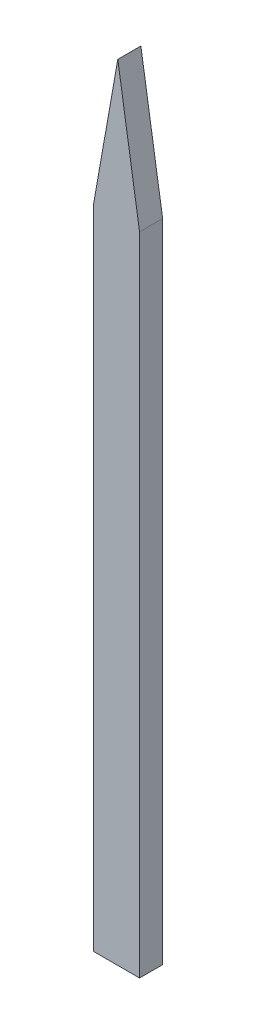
ISO-10303-21;
HEADER;
FILE_DESCRIPTION(('STEP AP214'),'2;1');
FILE_NAME('part.step','',(''),(''),'','','');
FILE_SCHEMA(('AUTOMOTIVE_DESIGN { 1 0 10303 214 1 1 1 1 }'));
ENDSEC;
DATA;
#1=APPLICATION_CONTEXT('core data for automotive mechanical design processes');
#2=APPLICATION_PROTOCOL_DEFINITION('international standard','automotive_design',2000,#1);
#3=PRODUCT_CONTEXT('',#1,'mechanical');
#4=PRODUCT('Part','Part','',(#3));
#5=PRODUCT_RELATED_PRODUCT_CATEGORY('part','',(#4));
#6=PRODUCT_DEFINITION_FORMATION('','',#4);
#7=PRODUCT_DEFINITION_CONTEXT('part definition',#1,'design');
#8=PRODUCT_DEFINITION('design','',#6,#7);
#9=PRODUCT_DEFINITION_SHAPE('','',#8);
#10=(LENGTH_UNIT() NAMED_UNIT(*) SI_UNIT(.MILLI.,.METRE.));
#11=(NAMED_UNIT(*) PLANE_ANGLE_UNIT() SI_UNIT($,.RADIAN.));
#12=(NAMED_UNIT(*) SI_UNIT($,.STERADIAN.) SOLID_ANGLE_UNIT());
#13=UNCERTAINTY_MEASURE_WITH_UNIT(LENGTH_MEASURE(1.E-05),#10,'distance_accuracy_value','');
#14=(GEOMETRIC_REPRESENTATION_CONTEXT(3) GLOBAL_UNCERTAINTY_ASSIGNED_CONTEXT((#13)) GLOBAL_UNIT_ASSIGNED_CONTEXT((#10,
#11,#12)) REPRESENTATION_CONTEXT('',''));
#15=CARTESIAN_POINT('',(0.,0.,0.));
#16=DIRECTION('',(0.,0.,1.));
#17=DIRECTION('',(1.,0.,0.));
#18=AXIS2_PLACEMENT_3D('',#15,#16,#17);
#19=CARTESIAN_POINT('',(1.,0.,0.5));
#20=DIRECTION('',(0.,1.,0.));
#21=DIRECTION('',(-1.,0.,0.));
#22=AXIS2_PLACEMENT_3D('',#19,#20,#21);
#23=PLANE('',#22);
#24=DIRECTION('',(1.,0.,0.));
#25=VECTOR('',#24,1.);
#26=CARTESIAN_POINT('',(1.,0.,0.));
#27=LINE('',#26,#25);
#28=CARTESIAN_POINT('',(0.,0.,0.));
#29=VERTEX_POINT('',#28);
#30=CARTESIAN_POINT('',(1.,0.,0.));
#31=VERTEX_POINT('',#30);
#32=EDGE_CURVE('E79',#29,#31,#27,.T.);
#33=ORIENTED_EDGE('',*,*,#32,.T.);
#34=DIRECTION('',(0.,0.,-1.));
#35=VECTOR('',#34,1.);
#36=CARTESIAN_POINT('',(1.,0.,0.5));
#37=LINE('',#36,#35);
#38=CARTESIAN_POINT('',(1.,0.,0.5));
#39=VERTEX_POINT('',#38);
#40=EDGE_CURVE('E11',#39,#31,#37,.T.);
#41=ORIENTED_EDGE('',*,*,#40,.F.);
#42=DIRECTION('',(1.,0.,0.));
#43=VECTOR('',#42,1.);
#44=CARTESIAN_POINT('',(1.,0.,0.5));
#45=LINE('',#44,#43);
#46=CARTESIAN_POINT('',(0.,0.,0.5));
#47=VERTEX_POINT('',#46);
#48=EDGE_CURVE('E100',#47,#39,#45,.T.);
#49=ORIENTED_EDGE('',*,*,#48,.F.);
#50=DIRECTION('',(0.,0.,-1.));
#51=VECTOR('',#50,1.);
#52=CARTESIAN_POINT('',(0.,0.,0.5));
#53=LINE('',#52,#51);
#54=EDGE_CURVE('E92',#47,#29,#53,.T.);
#55=ORIENTED_EDGE('',*,*,#54,.T.);
#56=EDGE_LOOP('',(#33,#41,#49,#55));
#57=FACE_BOUND('',#56,.T.);
#58=ADVANCED_FACE('F29',(#57),#23,.F.);
#59=CARTESIAN_POINT('',(1.,14.,0.5));
#60=DIRECTION('',(-1.,0.,0.));
#61=DIRECTION('',(0.,-1.,0.));
#62=AXIS2_PLACEMENT_3D('',#59,#60,#61);
#63=PLANE('',#62);
#64=DIRECTION('',(0.,1.,0.));
#65=VECTOR('',#64,1.);
#66=CARTESIAN_POINT('',(1.,14.,0.));
#67=LINE('',#66,#65);
#68=CARTESIAN_POINT('',(1.,14.,0.));
#69=VERTEX_POINT('',#68);
#70=EDGE_CURVE('E75',#31,#69,#67,.T.);
#71=ORIENTED_EDGE('',*,*,#70,.T.);
#72=DIRECTION('',(0.,0.,-1.));
#73=VECTOR('',#72,1.);
#74=CARTESIAN_POINT('',(1.,14.,0.5));
#75=LINE('',#74,#73);
#76=CARTESIAN_POINT('',(1.,14.,0.5));
#77=VERTEX_POINT('',#76);
#78=EDGE_CURVE('E36',#77,#69,#75,.T.);
#79=ORIENTED_EDGE('',*,*,#78,.F.);
#80=DIRECTION('',(0.,1.,0.));
#81=VECTOR('',#80,1.);
#82=CARTESIAN_POINT('',(1.,14.,0.5));
#83=LINE('',#82,#81);
#84=EDGE_CURVE('E88',#39,#77,#83,.T.);
#85=ORIENTED_EDGE('',*,*,#84,.F.);
#86=ORIENTED_EDGE('',*,*,#40,.T.);
#87=EDGE_LOOP('',(#71,#79,#85,#86));
#88=FACE_BOUND('',#87,.T.);
#89=ADVANCED_FACE('F87',(#88),#63,.F.);
#90=CARTESIAN_POINT('',(0.528980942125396,17.,0.5));
#91=DIRECTION('',(-0.987897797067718,-0.155106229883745,0.));
#92=DIRECTION('',(0.155106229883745,-0.987897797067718,0.));
#93=AXIS2_PLACEMENT_3D('',#90,#91,#92);
#94=PLANE('',#93);
#95=DIRECTION('',(-0.155106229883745,0.987897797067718,0.));
#96=VECTOR('',#95,1.);
#97=CARTESIAN_POINT('',(0.528980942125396,17.,0.));
#98=LINE('',#97,#96);
#99=CARTESIAN_POINT('',(0.528980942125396,17.,0.));
#100=VERTEX_POINT('',#99);
#101=EDGE_CURVE('E81',#69,#100,#98,.T.);
#102=ORIENTED_EDGE('',*,*,#101,.T.);
#103=DIRECTION('',(0.,0.,-1.));
#104=VECTOR('',#103,1.);
#105=CARTESIAN_POINT('',(0.528980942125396,17.,0.5));
#106=LINE('',#105,#104);
#107=CARTESIAN_POINT('',(0.528980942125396,17.,0.5));
#108=VERTEX_POINT('',#107);
#109=EDGE_CURVE('E111',#108,#100,#106,.T.);
#110=ORIENTED_EDGE('',*,*,#109,.F.);
#111=DIRECTION('',(-0.155106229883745,0.987897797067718,0.));
#112=VECTOR('',#111,1.);
#113=CARTESIAN_POINT('',(0.528980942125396,17.,0.5));
#114=LINE('',#113,#112);
#115=EDGE_CURVE('E103',#77,#108,#114,.T.);
#116=ORIENTED_EDGE('',*,*,#115,.F.);
#117=ORIENTED_EDGE('',*,*,#78,.T.);
#118=EDGE_LOOP('',(#102,#110,#116,#117));
#119=FACE_BOUND('',#118,.T.);
#120=ADVANCED_FACE('F115',(#119),#94,.F.);
#121=CARTESIAN_POINT('',(0.,14.,0.5));
#122=DIRECTION('',(0.984807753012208,-0.173648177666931,0.));
#123=DIRECTION('',(0.173648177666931,0.984807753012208,0.));
#124=AXIS2_PLACEMENT_3D('',#121,#122,#123);
#125=PLANE('',#124);
#126=DIRECTION('',(-0.173648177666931,-0.984807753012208,0.));
#127=VECTOR('',#126,1.);
#128=CARTESIAN_POINT('',(0.,14.,0.));
#129=LINE('',#128,#127);
#130=CARTESIAN_POINT('',(0.,14.,0.));
#131=VERTEX_POINT('',#130);
#132=EDGE_CURVE('E96',#100,#131,#129,.T.);
#133=ORIENTED_EDGE('',*,*,#132,.T.);
#134=DIRECTION('',(0.,0.,-1.));
#135=VECTOR('',#134,1.);
#136=CARTESIAN_POINT('',(0.,14.,0.5));
#137=LINE('',#136,#135);
#138=CARTESIAN_POINT('',(0.,14.,0.5));
#139=VERTEX_POINT('',#138);
#140=EDGE_CURVE('E108',#139,#131,#137,.T.);
#141=ORIENTED_EDGE('',*,*,#140,.F.);
#142=DIRECTION('',(-0.173648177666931,-0.984807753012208,0.));
#143=VECTOR('',#142,1.);
#144=CARTESIAN_POINT('',(0.,14.,0.5));
#145=LINE('',#144,#143);
#146=EDGE_CURVE('E48',#108,#139,#145,.T.);
#147=ORIENTED_EDGE('',*,*,#146,.F.);
#148=ORIENTED_EDGE('',*,*,#109,.T.);
#149=EDGE_LOOP('',(#133,#141,#147,#148));
#150=FACE_BOUND('',#149,.T.);
#151=ADVANCED_FACE('F126',(#150),#125,.F.);
#152=CARTESIAN_POINT('',(0.,0.,0.5));
#153=DIRECTION('',(1.,0.,0.));
#154=DIRECTION('',(0.,0.,-1.));
#155=AXIS2_PLACEMENT_3D('',#152,#153,#154);
#156=PLANE('',#155);
#157=DIRECTION('',(0.,-1.,0.));
#158=VECTOR('',#157,1.);
#159=CARTESIAN_POINT('',(0.,0.,0.));
#160=LINE('',#159,#158);
#161=EDGE_CURVE('E98',#131,#29,#160,.T.);
#162=ORIENTED_EDGE('',*,*,#161,.T.);
#163=ORIENTED_EDGE('',*,*,#54,.F.);
#164=DIRECTION('',(0.,-1.,0.));
#165=VECTOR('',#164,1.);
#166=CARTESIAN_POINT('',(0.,0.,0.5));
#167=LINE('',#166,#165);
#168=EDGE_CURVE('E43',#139,#47,#167,.T.);
#169=ORIENTED_EDGE('',*,*,#168,.F.);
#170=ORIENTED_EDGE('',*,*,#140,.T.);
#171=EDGE_LOOP('',(#162,#163,#169,#170));
#172=FACE_BOUND('',#171,.T.);
#173=ADVANCED_FACE('F119',(#172),#156,.F.);
#174=CARTESIAN_POINT('',(0.,0.,0.5));
#175=DIRECTION('',(0.,0.,-1.));
#176=DIRECTION('',(-1.,0.,0.));
#177=AXIS2_PLACEMENT_3D('',#174,#175,#176);
#178=PLANE('',#177);
#179=ORIENTED_EDGE('',*,*,#48,.T.);
#180=ORIENTED_EDGE('',*,*,#84,.T.);
#181=ORIENTED_EDGE('',*,*,#115,.T.);
#182=ORIENTED_EDGE('',*,*,#146,.T.);
#183=ORIENTED_EDGE('',*,*,#168,.T.);
#184=EDGE_LOOP('',(#179,#180,#181,#182,#183));
#185=FACE_BOUND('',#184,.T.);
#186=ADVANCED_FACE('F117',(#185),#178,.F.);
#187=CARTESIAN_POINT('',(0.,0.,0.));
#188=DIRECTION('',(0.,0.,-1.));
#189=DIRECTION('',(-1.,0.,0.));
#190=AXIS2_PLACEMENT_3D('',#187,#188,#189);
#191=PLANE('',#190);
#192=ORIENTED_EDGE('',*,*,#32,.F.);
#193=ORIENTED_EDGE('',*,*,#161,.F.);
#194=ORIENTED_EDGE('',*,*,#132,.F.);
#195=ORIENTED_EDGE('',*,*,#101,.F.);
#196=ORIENTED_EDGE('',*,*,#70,.F.);
#197=EDGE_LOOP('',(#192,#193,#194,#195,#196));
#198=FACE_BOUND('',#197,.T.);
#199=ADVANCED_FACE('F76',(#198),#191,.T.);
#200=CLOSED_SHELL('',(#58,#89,#120,#151,#173,#186,#199));
#201=MANIFOLD_SOLID_BREP('B2',#200);
#202=ADVANCED_BREP_SHAPE_REPRESENTATION('',(#18,#201),#14);
#203=SHAPE_DEFINITION_REPRESENTATION(#9,#202);
ENDSEC;
END-ISO-10303-21;
